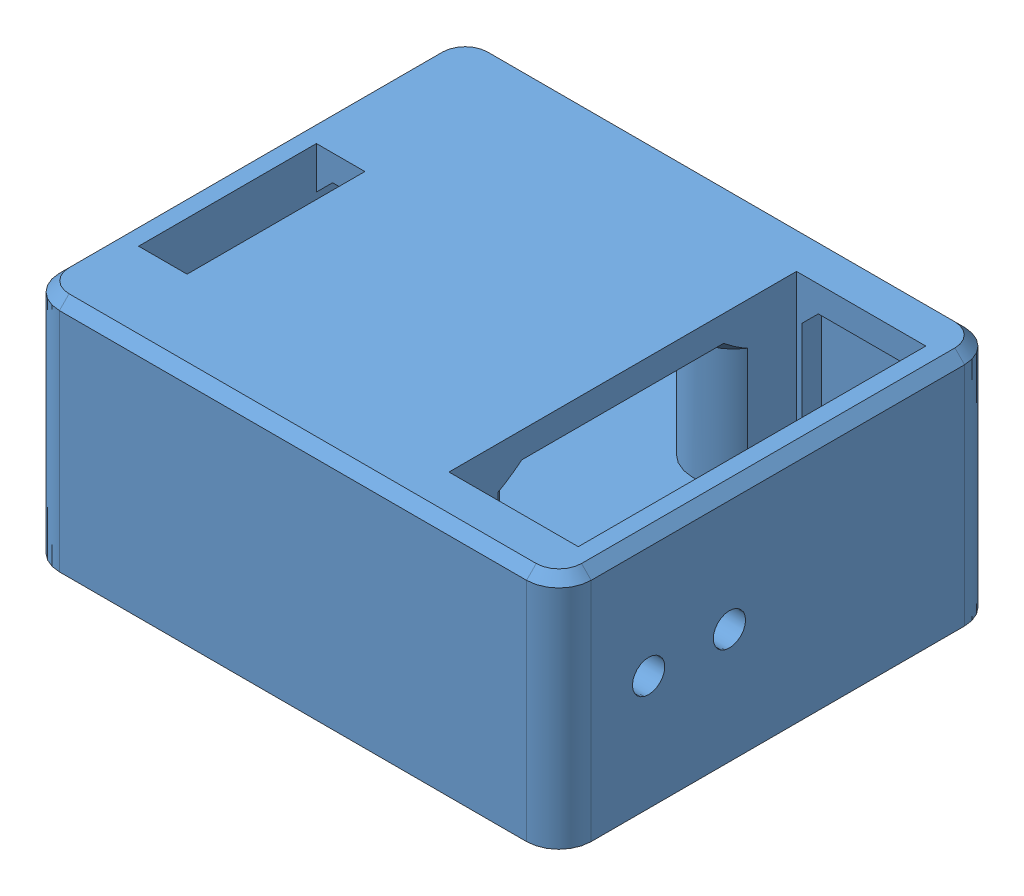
SolidWorks assembly H-bridge.SLDASM, configuration Výchozí (file format 7000). Lengths in mm.
Overall size (32.9 14.6 27.1).
3 component instances, 1 part files, 6 mates.
Components (placement in the parent):
- H-bridge-1: H-bridge.SLDPRT [Horní díl] at (-3.163 10.3103 -7.1582) size (32.9 14.6 27.1)
- H-bridge-2: H-bridge.SLDPRT [Spodní díl] at (-3.163 10.3103 -7.1582) size (29.2 3.2 23.4)
- H-bridge-3: H-bridge.SLDPRT [Modul] at (-3.163 10.3103 -7.1582) size (29.2 1.2 23.4)
Mates (geometry in assembly coordinates):
- Sjednocená39: coincident aligned: plane of H-bridge-1 through (-3.163 5.7103 -7.1582) normal (0 -1 0); plane of H-bridge-2 through (-3.163 5.7103 -7.1582) normal (0 -1 0)
- Soustředná30: concentric anti-aligned: cylinder of H-bridge-1 through (1.537 10.3103 1.8418) axis (0 1 0) radius 1.35; cylinder of H-bridge-2 through (1.537 8.9103 1.8418) axis (0 -1 0) radius 1.6
- Soustředná31: concentric anti-aligned: cylinder of H-bridge-1 through (-11.763 10.3103 -16.1582) axis (0 1 0) radius 1.35; cylinder of H-bridge-2 through (-11.763 8.9103 -16.1582) axis (0 -1 0) radius 1.6
- Soustředná32: concentric aligned: cylinder of H-bridge-1 through (1.537 10.3103 1.8418) axis (0 1 0) radius 1.35; cylinder of H-bridge-3 through (1.537 9.1103 1.8418) axis (0 1 0) radius 1.5
- Soustředná33: concentric aligned: cylinder of H-bridge-1 through (-11.763 10.3103 -16.1582) axis (0 1 0) radius 1.35; circle of H-bridge-3
- Sjednocená40: coincident anti-aligned: plane of H-bridge-1 through (1.537 10.3103 -16.1582) normal (0 -1 0); plane of H-bridge-3 through (-3.163 10.3103 -7.1582) normal (0 1 0)
